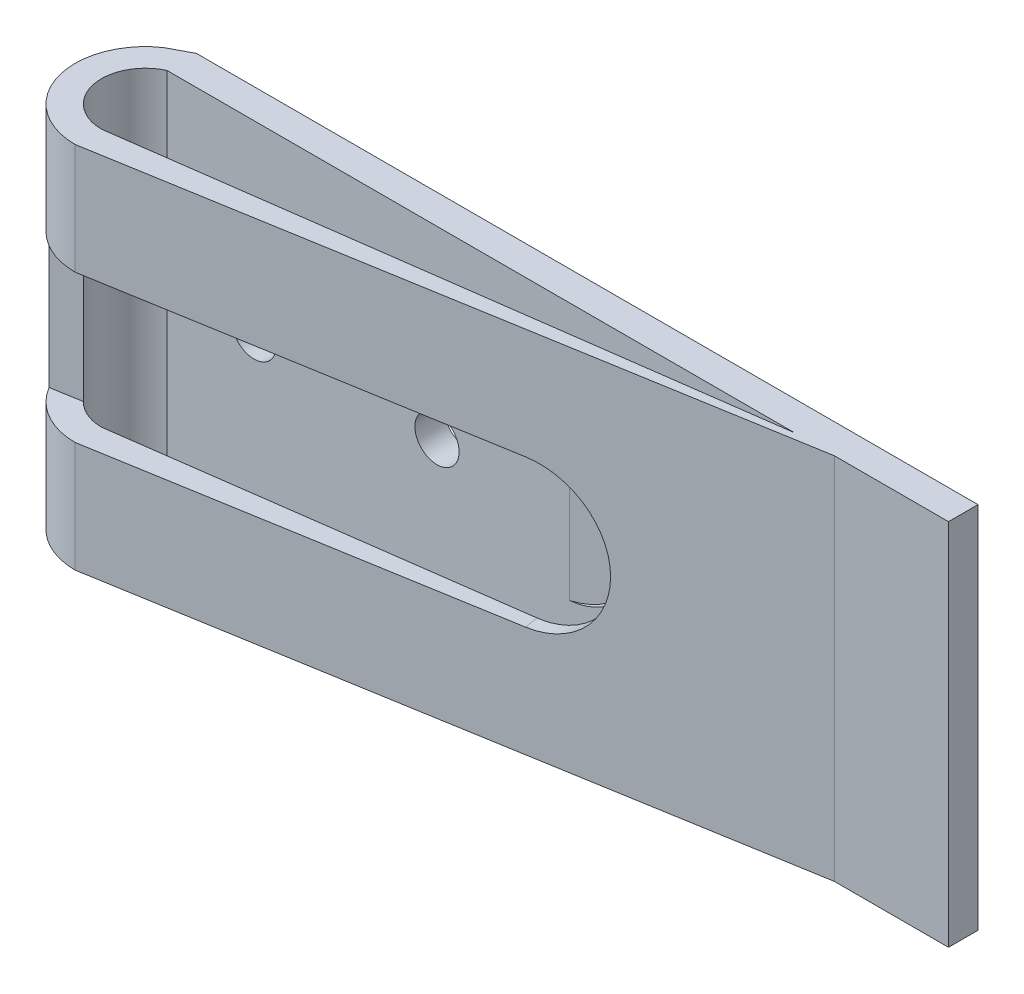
from build123d import *

# Parameters (mm, degrees)
ESQUISSE1_W             = 53
ESQUISSE1_H             = 25
ESQUISSE1_R             = 1.5
BOSS_EXTRU_1_DEPTH      = 2
BOSS_EXTRU_2_DEPTH      = 25
ENL_V_MAT_EXTRU_1_DEPTH = 3


with BuildPart() as part:
    # Esquisse1 → Boss.-Extru.1 (new body)
    with BuildSketch(Plane.XY):
        Rectangle(ESQUISSE1_W, ESQUISSE1_H)
        with Locations((-20.598353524, 0)):
            Circle(ESQUISSE1_R, mode=Mode.SUBTRACT)
        with Locations((-8.188165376, 0)):
            Circle(ESQUISSE1_R, mode=Mode.SUBTRACT)
    extrude(amount=BOSS_EXTRU_1_DEPTH)

    # Esquisse2 → Boss.-Extru.2 (add)
    with BuildSketch(Plane(origin=(0, -12.5, 0), x_dir=(-1, 0, 0), z_dir=(0, -1, 0))):
        with BuildLine():
            Line((25.270115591, -7.671177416), (-16.069955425, -2))
            Line((-16.069955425, -2), (-18.756660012, -2))
            Line((-18.756660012, -2), (25.270115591, -9.463457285))
            ThreePointArc((25.270115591, -9.463457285), (29.820429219, -6.103636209), (27.948770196, -0.765973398))
            Line((27.948770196, -0.765973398), (26.5, 0))
            Line((26.5, 0), (26.5, -2))
            ThreePointArc((26.5, -2), (28.171618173, -5.331465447), (25.270115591, -7.671177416))
        make_face()
    extrude(amount=-BOSS_EXTRU_2_DEPTH)

    # Esquisse3 → Enl_v. mat.-Extru.1 (cut)
    with BuildSketch(Plane(origin=(0.853529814, 0, 5.034954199), x_dir=(0.9859337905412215, 0, -0.1671363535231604), z_dir=(0.1671363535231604, 0, 0.9859337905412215))):
        with BuildLine():
            Line((0, 5), (-30.461802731, 5))
            Line((-30.461802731, 5), (-30.461802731, -5))
            Line((-30.461802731, -5), (0, -5))
            ThreePointArc((0, -5), (5, 0), (0, 5))
        make_face()
    extrude(amount=-ENL_V_MAT_EXTRU_1_DEPTH, mode=Mode.SUBTRACT)


solid = part.part
